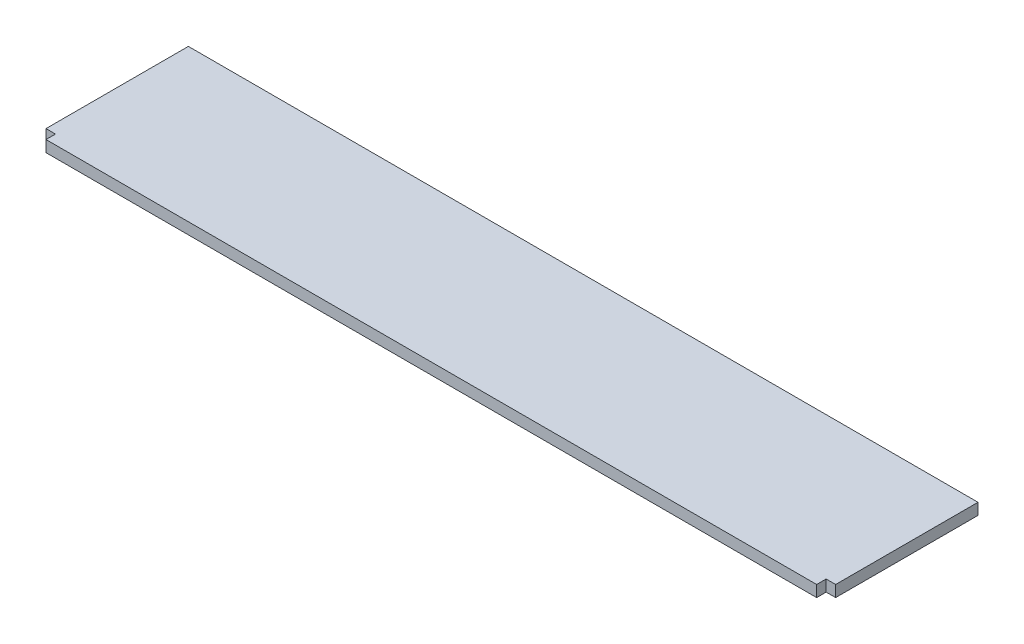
ISO-10303-21;
HEADER;
FILE_DESCRIPTION(('STEP AP214'),'2;1');
FILE_NAME('part.step','',(''),(''),'','','');
FILE_SCHEMA(('AUTOMOTIVE_DESIGN { 1 0 10303 214 1 1 1 1 }'));
ENDSEC;
DATA;
#1=APPLICATION_CONTEXT('core data for automotive mechanical design processes');
#2=APPLICATION_PROTOCOL_DEFINITION('international standard','automotive_design',2000,#1);
#3=PRODUCT_CONTEXT('',#1,'mechanical');
#4=PRODUCT('Part','Part','',(#3));
#5=PRODUCT_RELATED_PRODUCT_CATEGORY('part','',(#4));
#6=PRODUCT_DEFINITION_FORMATION('','',#4);
#7=PRODUCT_DEFINITION_CONTEXT('part definition',#1,'design');
#8=PRODUCT_DEFINITION('design','',#6,#7);
#9=PRODUCT_DEFINITION_SHAPE('','',#8);
#10=(LENGTH_UNIT() NAMED_UNIT(*) SI_UNIT(.MILLI.,.METRE.));
#11=(NAMED_UNIT(*) PLANE_ANGLE_UNIT() SI_UNIT($,.RADIAN.));
#12=(NAMED_UNIT(*) SI_UNIT($,.STERADIAN.) SOLID_ANGLE_UNIT());
#13=UNCERTAINTY_MEASURE_WITH_UNIT(LENGTH_MEASURE(1.E-05),#10,'distance_accuracy_value','');
#14=(GEOMETRIC_REPRESENTATION_CONTEXT(3) GLOBAL_UNCERTAINTY_ASSIGNED_CONTEXT((#13)) GLOBAL_UNIT_ASSIGNED_CONTEXT((#10,
#11,#12)) REPRESENTATION_CONTEXT('',''));
#15=CARTESIAN_POINT('',(0.,0.,0.));
#16=DIRECTION('',(0.,0.,1.));
#17=DIRECTION('',(1.,0.,0.));
#18=AXIS2_PLACEMENT_3D('',#15,#16,#17);
#19=CARTESIAN_POINT('',(0.,30.,0.));
#20=DIRECTION('',(1.,0.,0.));
#21=DIRECTION('',(0.,0.,-1.));
#22=AXIS2_PLACEMENT_3D('',#19,#20,#21);
#23=PLANE('',#22);
#24=DIRECTION('',(0.,0.,1.));
#25=VECTOR('',#24,1.);
#26=CARTESIAN_POINT('',(0.,0.,0.));
#27=LINE('',#26,#25);
#28=CARTESIAN_POINT('',(0.,0.,-400.));
#29=VERTEX_POINT('',#28);
#30=CARTESIAN_POINT('',(0.,0.,-25.));
#31=VERTEX_POINT('',#30);
#32=EDGE_CURVE('E117',#29,#31,#27,.T.);
#33=ORIENTED_EDGE('',*,*,#32,.T.);
#34=DIRECTION('',(0.,1.,0.));
#35=VECTOR('',#34,1.);
#36=CARTESIAN_POINT('',(0.,0.,-25.));
#37=LINE('',#36,#35);
#38=CARTESIAN_POINT('',(0.,30.,-25.));
#39=VERTEX_POINT('',#38);
#40=EDGE_CURVE('E153',#31,#39,#37,.T.);
#41=ORIENTED_EDGE('',*,*,#40,.T.);
#42=DIRECTION('',(0.,0.,1.));
#43=VECTOR('',#42,1.);
#44=CARTESIAN_POINT('',(0.,30.,0.));
#45=LINE('',#44,#43);
#46=CARTESIAN_POINT('',(0.,30.,-400.));
#47=VERTEX_POINT('',#46);
#48=EDGE_CURVE('E126',#47,#39,#45,.T.);
#49=ORIENTED_EDGE('',*,*,#48,.F.);
#50=DIRECTION('',(0.,-1.,0.));
#51=VECTOR('',#50,1.);
#52=CARTESIAN_POINT('',(0.,30.,-400.));
#53=LINE('',#52,#51);
#54=EDGE_CURVE('E39',#47,#29,#53,.T.);
#55=ORIENTED_EDGE('',*,*,#54,.T.);
#56=EDGE_LOOP('',(#33,#41,#49,#55));
#57=FACE_BOUND('',#56,.T.);
#58=ADVANCED_FACE('F32',(#57),#23,.F.);
#59=CARTESIAN_POINT('',(0.,30.,0.));
#60=DIRECTION('',(0.,0.,-1.));
#61=DIRECTION('',(-1.,0.,0.));
#62=AXIS2_PLACEMENT_3D('',#59,#60,#61);
#63=PLANE('',#62);
#64=DIRECTION('',(1.,0.,0.));
#65=VECTOR('',#64,1.);
#66=CARTESIAN_POINT('',(0.,30.,0.));
#67=LINE('',#66,#65);
#68=CARTESIAN_POINT('',(25.,30.,0.));
#69=VERTEX_POINT('',#68);
#70=CARTESIAN_POINT('',(2055.,30.,0.));
#71=VERTEX_POINT('',#70);
#72=EDGE_CURVE('E112',#69,#71,#67,.T.);
#73=ORIENTED_EDGE('',*,*,#72,.F.);
#74=DIRECTION('',(0.,1.,0.));
#75=VECTOR('',#74,1.);
#76=CARTESIAN_POINT('',(25.,0.,0.));
#77=LINE('',#76,#75);
#78=CARTESIAN_POINT('',(25.,0.,0.));
#79=VERTEX_POINT('',#78);
#80=EDGE_CURVE('E100',#79,#69,#77,.T.);
#81=ORIENTED_EDGE('',*,*,#80,.F.);
#82=DIRECTION('',(1.,0.,0.));
#83=VECTOR('',#82,1.);
#84=CARTESIAN_POINT('',(0.,0.,0.));
#85=LINE('',#84,#83);
#86=CARTESIAN_POINT('',(2055.,0.,0.));
#87=VERTEX_POINT('',#86);
#88=EDGE_CURVE('E111',#79,#87,#85,.T.);
#89=ORIENTED_EDGE('',*,*,#88,.T.);
#90=DIRECTION('',(0.,1.,0.));
#91=VECTOR('',#90,1.);
#92=CARTESIAN_POINT('',(2055.,0.,0.));
#93=LINE('',#92,#91);
#94=EDGE_CURVE('E122',#87,#71,#93,.T.);
#95=ORIENTED_EDGE('',*,*,#94,.T.);
#96=EDGE_LOOP('',(#73,#81,#89,#95));
#97=FACE_BOUND('',#96,.T.);
#98=ADVANCED_FACE('F109',(#97),#63,.F.);
#99=CARTESIAN_POINT('',(2080.,30.,0.));
#100=DIRECTION('',(-1.,0.,0.));
#101=DIRECTION('',(0.,0.,1.));
#102=AXIS2_PLACEMENT_3D('',#99,#100,#101);
#103=PLANE('',#102);
#104=DIRECTION('',(0.,0.,-1.));
#105=VECTOR('',#104,1.);
#106=CARTESIAN_POINT('',(2080.,30.,0.));
#107=LINE('',#106,#105);
#108=CARTESIAN_POINT('',(2080.,30.,-25.));
#109=VERTEX_POINT('',#108);
#110=CARTESIAN_POINT('',(2080.,30.,-400.));
#111=VERTEX_POINT('',#110);
#112=EDGE_CURVE('E133',#109,#111,#107,.T.);
#113=ORIENTED_EDGE('',*,*,#112,.F.);
#114=DIRECTION('',(0.,1.,0.));
#115=VECTOR('',#114,1.);
#116=CARTESIAN_POINT('',(2080.,0.,-25.));
#117=LINE('',#116,#115);
#118=CARTESIAN_POINT('',(2080.,0.,-25.));
#119=VERTEX_POINT('',#118);
#120=EDGE_CURVE('E141',#119,#109,#117,.T.);
#121=ORIENTED_EDGE('',*,*,#120,.F.);
#122=DIRECTION('',(0.,0.,-1.));
#123=VECTOR('',#122,1.);
#124=CARTESIAN_POINT('',(2080.,0.,0.));
#125=LINE('',#124,#123);
#126=CARTESIAN_POINT('',(2080.,0.,-400.));
#127=VERTEX_POINT('',#126);
#128=EDGE_CURVE('E116',#119,#127,#125,.T.);
#129=ORIENTED_EDGE('',*,*,#128,.T.);
#130=DIRECTION('',(0.,-1.,0.));
#131=VECTOR('',#130,1.);
#132=CARTESIAN_POINT('',(2080.,30.,-400.));
#133=LINE('',#132,#131);
#134=EDGE_CURVE('E11',#111,#127,#133,.T.);
#135=ORIENTED_EDGE('',*,*,#134,.F.);
#136=EDGE_LOOP('',(#113,#121,#129,#135));
#137=FACE_BOUND('',#136,.T.);
#138=ADVANCED_FACE('F181',(#137),#103,.F.);
#139=CARTESIAN_POINT('',(0.,30.,-400.));
#140=DIRECTION('',(0.,0.,1.));
#141=DIRECTION('',(1.,0.,0.));
#142=AXIS2_PLACEMENT_3D('',#139,#140,#141);
#143=PLANE('',#142);
#144=DIRECTION('',(-1.,0.,0.));
#145=VECTOR('',#144,1.);
#146=CARTESIAN_POINT('',(0.,0.,-400.));
#147=LINE('',#146,#145);
#148=EDGE_CURVE('E119',#127,#29,#147,.T.);
#149=ORIENTED_EDGE('',*,*,#148,.T.);
#150=ORIENTED_EDGE('',*,*,#54,.F.);
#151=DIRECTION('',(-1.,0.,0.));
#152=VECTOR('',#151,1.);
#153=CARTESIAN_POINT('',(0.,30.,-400.));
#154=LINE('',#153,#152);
#155=EDGE_CURVE('E128',#111,#47,#154,.T.);
#156=ORIENTED_EDGE('',*,*,#155,.F.);
#157=ORIENTED_EDGE('',*,*,#134,.T.);
#158=EDGE_LOOP('',(#149,#150,#156,#157));
#159=FACE_BOUND('',#158,.T.);
#160=ADVANCED_FACE('F185',(#159),#143,.F.);
#161=CARTESIAN_POINT('',(0.,30.,0.));
#162=DIRECTION('',(0.,-1.,0.));
#163=DIRECTION('',(0.,0.,-1.));
#164=AXIS2_PLACEMENT_3D('',#161,#162,#163);
#165=PLANE('',#164);
#166=ORIENTED_EDGE('',*,*,#48,.T.);
#167=DIRECTION('',(-1.,0.,0.));
#168=VECTOR('',#167,1.);
#169=CARTESIAN_POINT('',(0.,30.,-25.));
#170=LINE('',#169,#168);
#171=CARTESIAN_POINT('',(25.,30.,-25.));
#172=VERTEX_POINT('',#171);
#173=EDGE_CURVE('E105',#172,#39,#170,.T.);
#174=ORIENTED_EDGE('',*,*,#173,.F.);
#175=DIRECTION('',(0.,0.,-1.));
#176=VECTOR('',#175,1.);
#177=CARTESIAN_POINT('',(25.,30.,0.));
#178=LINE('',#177,#176);
#179=EDGE_CURVE('E160',#69,#172,#178,.T.);
#180=ORIENTED_EDGE('',*,*,#179,.F.);
#181=ORIENTED_EDGE('',*,*,#72,.T.);
#182=DIRECTION('',(0.,0.,1.));
#183=VECTOR('',#182,1.);
#184=CARTESIAN_POINT('',(2055.,30.,0.));
#185=LINE('',#184,#183);
#186=CARTESIAN_POINT('',(2055.,30.,-25.));
#187=VERTEX_POINT('',#186);
#188=EDGE_CURVE('E146',#187,#71,#185,.T.);
#189=ORIENTED_EDGE('',*,*,#188,.F.);
#190=DIRECTION('',(-1.,0.,0.));
#191=VECTOR('',#190,1.);
#192=CARTESIAN_POINT('',(2080.,30.,-25.));
#193=LINE('',#192,#191);
#194=EDGE_CURVE('E150',#109,#187,#193,.T.);
#195=ORIENTED_EDGE('',*,*,#194,.F.);
#196=ORIENTED_EDGE('',*,*,#112,.T.);
#197=ORIENTED_EDGE('',*,*,#155,.T.);
#198=EDGE_LOOP('',(#166,#174,#180,#181,#189,#195,#196,#197));
#199=FACE_BOUND('',#198,.T.);
#200=ADVANCED_FACE('F164',(#199),#165,.F.);
#201=CARTESIAN_POINT('',(0.,0.,0.));
#202=DIRECTION('',(0.,-1.,0.));
#203=DIRECTION('',(0.,0.,-1.));
#204=AXIS2_PLACEMENT_3D('',#201,#202,#203);
#205=PLANE('',#204);
#206=DIRECTION('',(-1.,0.,0.));
#207=VECTOR('',#206,1.);
#208=CARTESIAN_POINT('',(0.,0.,-25.));
#209=LINE('',#208,#207);
#210=CARTESIAN_POINT('',(25.,0.,-25.));
#211=VERTEX_POINT('',#210);
#212=EDGE_CURVE('E46',#211,#31,#209,.T.);
#213=ORIENTED_EDGE('',*,*,#212,.T.);
#214=ORIENTED_EDGE('',*,*,#32,.F.);
#215=ORIENTED_EDGE('',*,*,#148,.F.);
#216=ORIENTED_EDGE('',*,*,#128,.F.);
#217=DIRECTION('',(-1.,0.,0.));
#218=VECTOR('',#217,1.);
#219=CARTESIAN_POINT('',(2080.,0.,-25.));
#220=LINE('',#219,#218);
#221=CARTESIAN_POINT('',(2055.,0.,-25.));
#222=VERTEX_POINT('',#221);
#223=EDGE_CURVE('E149',#119,#222,#220,.T.);
#224=ORIENTED_EDGE('',*,*,#223,.T.);
#225=DIRECTION('',(0.,0.,1.));
#226=VECTOR('',#225,1.);
#227=CARTESIAN_POINT('',(2055.,0.,0.));
#228=LINE('',#227,#226);
#229=EDGE_CURVE('E54',#222,#87,#228,.T.);
#230=ORIENTED_EDGE('',*,*,#229,.T.);
#231=ORIENTED_EDGE('',*,*,#88,.F.);
#232=DIRECTION('',(0.,0.,-1.));
#233=VECTOR('',#232,1.);
#234=CARTESIAN_POINT('',(25.,0.,0.));
#235=LINE('',#234,#233);
#236=EDGE_CURVE('E96',#79,#211,#235,.T.);
#237=ORIENTED_EDGE('',*,*,#236,.T.);
#238=EDGE_LOOP('',(#213,#214,#215,#216,#224,#230,#231,#237));
#239=FACE_BOUND('',#238,.T.);
#240=ADVANCED_FACE('F114',(#239),#205,.T.);
#241=CARTESIAN_POINT('',(2055.,0.,0.));
#242=DIRECTION('',(-1.,0.,0.));
#243=DIRECTION('',(0.,0.,1.));
#244=AXIS2_PLACEMENT_3D('',#241,#242,#243);
#245=PLANE('',#244);
#246=ORIENTED_EDGE('',*,*,#188,.T.);
#247=ORIENTED_EDGE('',*,*,#94,.F.);
#248=ORIENTED_EDGE('',*,*,#229,.F.);
#249=DIRECTION('',(0.,1.,0.));
#250=VECTOR('',#249,1.);
#251=CARTESIAN_POINT('',(2055.,0.,-25.));
#252=LINE('',#251,#250);
#253=EDGE_CURVE('E143',#222,#187,#252,.T.);
#254=ORIENTED_EDGE('',*,*,#253,.T.);
#255=EDGE_LOOP('',(#246,#247,#248,#254));
#256=FACE_BOUND('',#255,.T.);
#257=ADVANCED_FACE('F174',(#256),#245,.F.);
#258=CARTESIAN_POINT('',(2080.,0.,-25.));
#259=DIRECTION('',(0.,0.,-1.));
#260=DIRECTION('',(-1.,0.,0.));
#261=AXIS2_PLACEMENT_3D('',#258,#259,#260);
#262=PLANE('',#261);
#263=ORIENTED_EDGE('',*,*,#194,.T.);
#264=ORIENTED_EDGE('',*,*,#253,.F.);
#265=ORIENTED_EDGE('',*,*,#223,.F.);
#266=ORIENTED_EDGE('',*,*,#120,.T.);
#267=EDGE_LOOP('',(#263,#264,#265,#266));
#268=FACE_BOUND('',#267,.T.);
#269=ADVANCED_FACE('F167',(#268),#262,.F.);
#270=CARTESIAN_POINT('',(0.,0.,-25.));
#271=DIRECTION('',(0.,0.,-1.));
#272=DIRECTION('',(-1.,0.,0.));
#273=AXIS2_PLACEMENT_3D('',#270,#271,#272);
#274=PLANE('',#273);
#275=ORIENTED_EDGE('',*,*,#173,.T.);
#276=ORIENTED_EDGE('',*,*,#40,.F.);
#277=ORIENTED_EDGE('',*,*,#212,.F.);
#278=DIRECTION('',(0.,1.,0.));
#279=VECTOR('',#278,1.);
#280=CARTESIAN_POINT('',(25.,0.,-25.));
#281=LINE('',#280,#279);
#282=EDGE_CURVE('E102',#211,#172,#281,.T.);
#283=ORIENTED_EDGE('',*,*,#282,.T.);
#284=EDGE_LOOP('',(#275,#276,#277,#283));
#285=FACE_BOUND('',#284,.T.);
#286=ADVANCED_FACE('F165',(#285),#274,.F.);
#287=CARTESIAN_POINT('',(25.,0.,0.));
#288=DIRECTION('',(1.,0.,0.));
#289=DIRECTION('',(0.,0.,-1.));
#290=AXIS2_PLACEMENT_3D('',#287,#288,#289);
#291=PLANE('',#290);
#292=ORIENTED_EDGE('',*,*,#179,.T.);
#293=ORIENTED_EDGE('',*,*,#282,.F.);
#294=ORIENTED_EDGE('',*,*,#236,.F.);
#295=ORIENTED_EDGE('',*,*,#80,.T.);
#296=EDGE_LOOP('',(#292,#293,#294,#295));
#297=FACE_BOUND('',#296,.T.);
#298=ADVANCED_FACE('F99',(#297),#291,.F.);
#299=CLOSED_SHELL('',(#58,#98,#138,#160,#200,#240,#257,#269,#286,#298));
#300=MANIFOLD_SOLID_BREP('B2',#299);
#301=ADVANCED_BREP_SHAPE_REPRESENTATION('',(#18,#300),#14);
#302=SHAPE_DEFINITION_REPRESENTATION(#9,#301);
ENDSEC;
END-ISO-10303-21;
